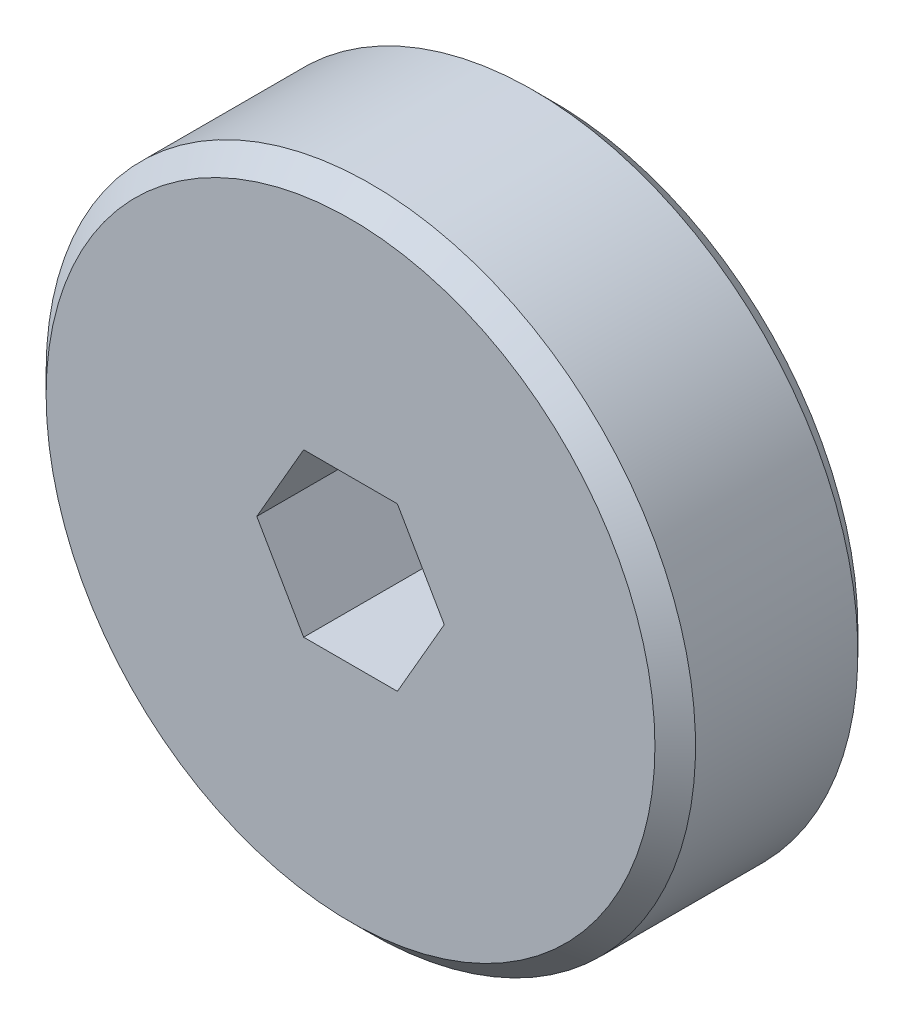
from build123d import *

# Parameters (mm, degrees)
CUT_EXTRUDE1_DEPTH = 20.636290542


with BuildPart() as part:
    # Logo3_bib1 → Revolve1 (revolve)
    with BuildSketch(Plane(origin=(0, 0, 0), x_dir=(-1, 0, 0), z_dir=(0, -1, 0))):
        Polygon((0, -7.9375), (0, 0), (11.90625, 0), (12.7, -0.79375), (12.7, -7.14375), (11.90625, -7.9375), align=None)
    revolve(axis=Axis((0, 0, -10.585154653), (0, 0, 1)))

    # Logo3_bib2 → Cut-Extrude1 (cut, through all)
    with BuildSketch(Plane(origin=(0, 0, 0), x_dir=(1, 0, 0), z_dir=(0, 0, -1))):
        Polygon((3.666174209, 0), (1.833087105, 3.175), (-1.833087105, 3.175), (-3.666174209, 0), (-1.833087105, -3.175), (1.833087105, -3.175), align=None)
    extrude(amount=-CUT_EXTRUDE1_DEPTH, mode=Mode.SUBTRACT)


solid = part.part
